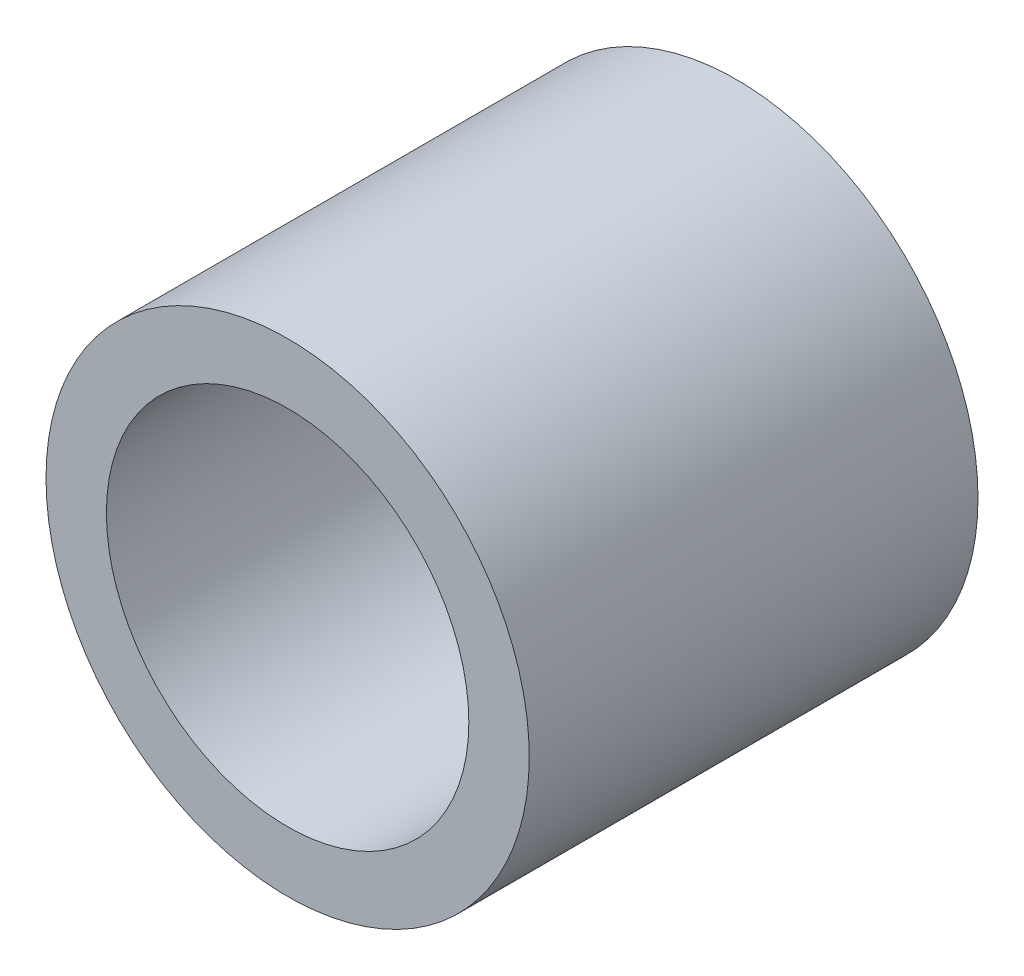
from build123d import *

# Parameters (mm, degrees)
ESQUISSE1_R      = 7
ESQUISSE1_R_2    = 5.25
EXTRUSION1_DEPTH = 13


with BuildPart() as part:
    # Esquisse1 → Extrusion1 (new body)
    with BuildSketch(Plane.XY):
        with Locations(Location((0, 0, 0), (0, 0, 180))):
            Circle(ESQUISSE1_R)
        with Locations(Location((0, 0, 0), (0, 0, 180))):
            Circle(ESQUISSE1_R_2, mode=Mode.SUBTRACT)
    extrude(amount=EXTRUSION1_DEPTH)


solid = part.part
